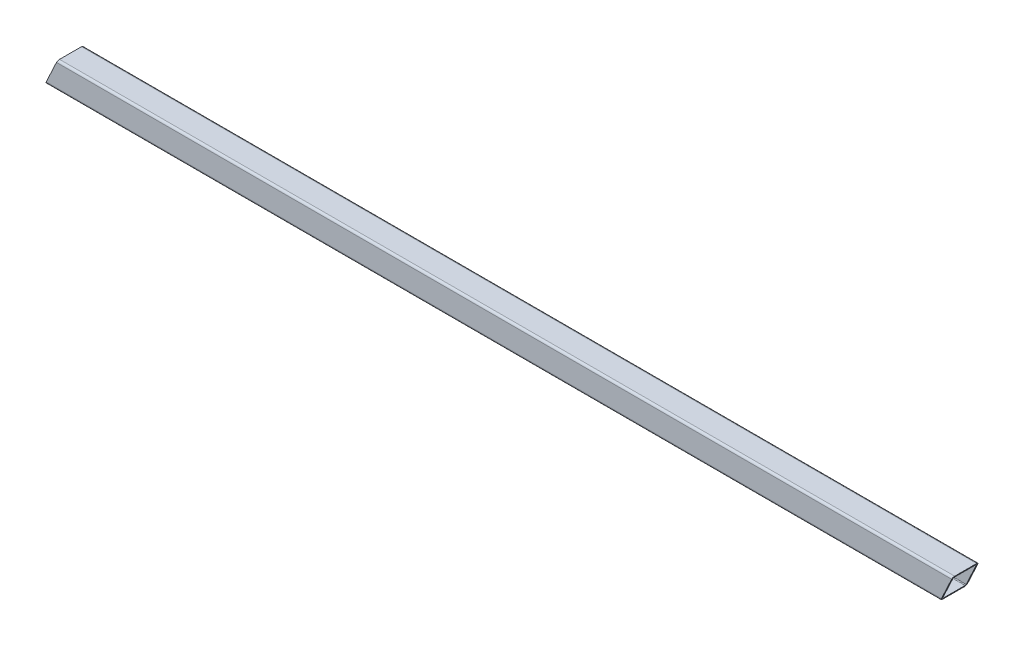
from build123d import *

# Parameters (mm, degrees)
BOSS_EXTRUDE1_DEPTH = 1320.8
SCALE4_SCALE_X      = 1
SCALE4_SCALE_Y      = 0.4
SCALE4_SCALE_Z      = 0.4
CUT_EXTRUDE1_DEPTH  = 1322.04802369
CUT_EXTRUDE2_DEPTH  = 1322.04802369


with BuildPart() as part:
    # Sketch1 → Boss-Extrude1 (new body)
    with BuildSketch(Plane(origin=(0, 0, 0), x_dir=(0, 0, -1), z_dir=(1, 0, 0))):
        with BuildLine():
            Line((0, 2.54), (0, 29.21))
            ThreePointArc((0, 29.21), (-0.743948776, 31.006051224), (-2.54, 31.75))
            Line((-2.54, 31.75), (-29.21, 31.75))
            ThreePointArc((-29.21, 31.75), (-31.006051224, 31.006051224), (-31.75, 29.21))
            Line((-31.75, 29.21), (-31.75, 2.54))
            ThreePointArc((-31.75, 2.54), (-31.006051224, 0.743948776), (-29.21, 0))
            Line((-29.21, 0), (-2.54, 0))
            ThreePointArc((-2.54, 0), (-0.743948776, 0.743948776), (0, 2.54))
        make_face()
        with BuildLine():
            Line((-1.651, 2.54), (-1.651, 29.21))
            ThreePointArc((-1.651, 29.21), (-1.911382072, 29.838617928), (-2.54, 30.099))
            Line((-2.54, 30.099), (-29.21, 30.099))
            ThreePointArc((-29.21, 30.099), (-29.838617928, 29.838617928), (-30.099, 29.21))
            Line((-30.099, 29.21), (-30.099, 2.54))
            ThreePointArc((-30.099, 2.54), (-29.838617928, 1.911382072), (-29.21, 1.651))
            Line((-29.21, 1.651), (-2.54, 1.651))
            ThreePointArc((-2.54, 1.651), (-1.911382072, 1.911382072), (-1.651, 2.54))
        make_face(mode=Mode.SUBTRACT)
    extrude(amount=BOSS_EXTRUDE1_DEPTH)


with BuildPart() as part_1:
    # Scale4: scaled about (660.4, 15.875, 15.875)
    add(part.part.scale((SCALE4_SCALE_X, SCALE4_SCALE_Y, SCALE4_SCALE_Z), about=(660.4, 15.875, 15.875)))

    # Sketch3 → Cut-Extrude1 (cut, through all)
    with BuildSketch(Plane.XY.offset(22.225)):
        Polygon((497.187439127, 5.160044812), (507.503428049, 27.282754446), (-75.281603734, 76.208792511), (44.814264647, -65.899686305), align=None)
    extrude(amount=-CUT_EXTRUDE1_DEPTH, mode=Mode.SUBTRACT)

    # Sketch4 → Cut-Extrude2 (cut, through all)
    with BuildSketch(Plane.XY.offset(22.225)):
        Polygon((927.702443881, -3.171111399), (947.216381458, 38.676662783), (1343.377537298, 38.676662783), (1343.377537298, -18.686907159), align=None)
    extrude(amount=-CUT_EXTRUDE2_DEPTH, mode=Mode.SUBTRACT)


solid = part_1.part
